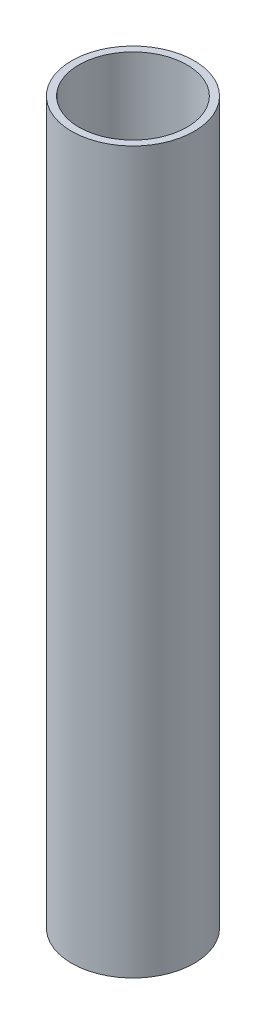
ISO-10303-21;
HEADER;
FILE_DESCRIPTION(('STEP AP214'),'2;1');
FILE_NAME('part.step','',(''),(''),'','','');
FILE_SCHEMA(('AUTOMOTIVE_DESIGN { 1 0 10303 214 1 1 1 1 }'));
ENDSEC;
DATA;
#1=APPLICATION_CONTEXT('core data for automotive mechanical design processes');
#2=APPLICATION_PROTOCOL_DEFINITION('international standard','automotive_design',2000,#1);
#3=PRODUCT_CONTEXT('',#1,'mechanical');
#4=PRODUCT('Part','Part','',(#3));
#5=PRODUCT_RELATED_PRODUCT_CATEGORY('part','',(#4));
#6=PRODUCT_DEFINITION_FORMATION('','',#4);
#7=PRODUCT_DEFINITION_CONTEXT('part definition',#1,'design');
#8=PRODUCT_DEFINITION('design','',#6,#7);
#9=PRODUCT_DEFINITION_SHAPE('','',#8);
#10=(LENGTH_UNIT() NAMED_UNIT(*) SI_UNIT(.MILLI.,.METRE.));
#11=(NAMED_UNIT(*) PLANE_ANGLE_UNIT() SI_UNIT($,.RADIAN.));
#12=(NAMED_UNIT(*) SI_UNIT($,.STERADIAN.) SOLID_ANGLE_UNIT());
#13=UNCERTAINTY_MEASURE_WITH_UNIT(LENGTH_MEASURE(1.E-05),#10,'distance_accuracy_value','');
#14=(GEOMETRIC_REPRESENTATION_CONTEXT(3) GLOBAL_UNCERTAINTY_ASSIGNED_CONTEXT((#13)) GLOBAL_UNIT_ASSIGNED_CONTEXT((#10,
#11,#12)) REPRESENTATION_CONTEXT('',''));
#15=CARTESIAN_POINT('',(0.,0.,0.));
#16=DIRECTION('',(0.,0.,1.));
#17=DIRECTION('',(1.,0.,0.));
#18=AXIS2_PLACEMENT_3D('',#15,#16,#17);
#19=CARTESIAN_POINT('',(0.,100.,0.));
#20=DIRECTION('',(0.,1.,0.));
#21=DIRECTION('',(0.,0.,1.));
#22=AXIS2_PLACEMENT_3D('',#19,#20,#21);
#23=PLANE('',#22);
#24=CARTESIAN_POINT('',(0.,100.,0.));
#25=DIRECTION('',(0.,1.,0.));
#26=DIRECTION('',(0.,0.,1.));
#27=AXIS2_PLACEMENT_3D('',#24,#25,#26);
#28=CIRCLE('',#27,8.5);
#29=CARTESIAN_POINT('',(0.,100.,8.5));
#30=VERTEX_POINT('',#29);
#31=EDGE_CURVE('E10',#30,#30,#28,.T.);
#32=ORIENTED_EDGE('',*,*,#31,.T.);
#33=EDGE_LOOP('',(#32));
#34=FACE_BOUND('',#33,.T.);
#35=CARTESIAN_POINT('',(0.,100.,0.));
#36=DIRECTION('',(0.,1.,0.));
#37=DIRECTION('',(0.,0.,1.));
#38=AXIS2_PLACEMENT_3D('',#35,#36,#37);
#39=CIRCLE('',#38,7.5);
#40=CARTESIAN_POINT('',(0.,100.,7.5));
#41=VERTEX_POINT('',#40);
#42=EDGE_CURVE('E42',#41,#41,#39,.T.);
#43=ORIENTED_EDGE('',*,*,#42,.F.);
#44=EDGE_LOOP('',(#43));
#45=FACE_BOUND('',#44,.T.);
#46=ADVANCED_FACE('F31',(#34,#45),#23,.T.);
#47=CARTESIAN_POINT('',(0.,0.,0.));
#48=DIRECTION('',(0.,1.,0.));
#49=DIRECTION('',(0.,0.,1.));
#50=AXIS2_PLACEMENT_3D('',#47,#48,#49);
#51=PLANE('',#50);
#52=CARTESIAN_POINT('',(0.,0.,0.));
#53=DIRECTION('',(0.,1.,0.));
#54=DIRECTION('',(0.,0.,1.));
#55=AXIS2_PLACEMENT_3D('',#52,#53,#54);
#56=CIRCLE('',#55,8.5);
#57=CARTESIAN_POINT('',(0.,0.,8.5));
#58=VERTEX_POINT('',#57);
#59=EDGE_CURVE('E35',#58,#58,#56,.T.);
#60=ORIENTED_EDGE('',*,*,#59,.F.);
#61=EDGE_LOOP('',(#60));
#62=FACE_BOUND('',#61,.T.);
#63=CARTESIAN_POINT('',(0.,0.,0.));
#64=DIRECTION('',(0.,1.,0.));
#65=DIRECTION('',(0.,0.,1.));
#66=AXIS2_PLACEMENT_3D('',#63,#64,#65);
#67=CIRCLE('',#66,7.5);
#68=CARTESIAN_POINT('',(0.,0.,7.5));
#69=VERTEX_POINT('',#68);
#70=EDGE_CURVE('E44',#69,#69,#67,.T.);
#71=ORIENTED_EDGE('',*,*,#70,.T.);
#72=EDGE_LOOP('',(#71));
#73=FACE_BOUND('',#72,.T.);
#74=ADVANCED_FACE('F54',(#62,#73),#51,.F.);
#75=CARTESIAN_POINT('',(0.,100.,0.));
#76=DIRECTION('',(0.,-1.,0.));
#77=DIRECTION('',(0.,0.,-1.));
#78=AXIS2_PLACEMENT_3D('',#75,#76,#77);
#79=CYLINDRICAL_SURFACE('',#78,8.5);
#80=ORIENTED_EDGE('',*,*,#31,.F.);
#81=EDGE_LOOP('',(#80));
#82=FACE_BOUND('',#81,.T.);
#83=ORIENTED_EDGE('',*,*,#59,.T.);
#84=EDGE_LOOP('',(#83));
#85=FACE_BOUND('',#84,.T.);
#86=ADVANCED_FACE('F33',(#82,#85),#79,.T.);
#87=CARTESIAN_POINT('',(0.,100.,0.));
#88=DIRECTION('',(0.,-1.,0.));
#89=DIRECTION('',(0.,0.,-1.));
#90=AXIS2_PLACEMENT_3D('',#87,#88,#89);
#91=CYLINDRICAL_SURFACE('',#90,7.5);
#92=ORIENTED_EDGE('',*,*,#42,.T.);
#93=EDGE_LOOP('',(#92));
#94=FACE_BOUND('',#93,.T.);
#95=ORIENTED_EDGE('',*,*,#70,.F.);
#96=EDGE_LOOP('',(#95));
#97=FACE_BOUND('',#96,.T.);
#98=ADVANCED_FACE('F50',(#94,#97),#91,.F.);
#99=CLOSED_SHELL('',(#46,#74,#86,#98));
#100=MANIFOLD_SOLID_BREP('B2',#99);
#101=ADVANCED_BREP_SHAPE_REPRESENTATION('',(#18,#100),#14);
#102=SHAPE_DEFINITION_REPRESENTATION(#9,#101);
ENDSEC;
END-ISO-10303-21;
